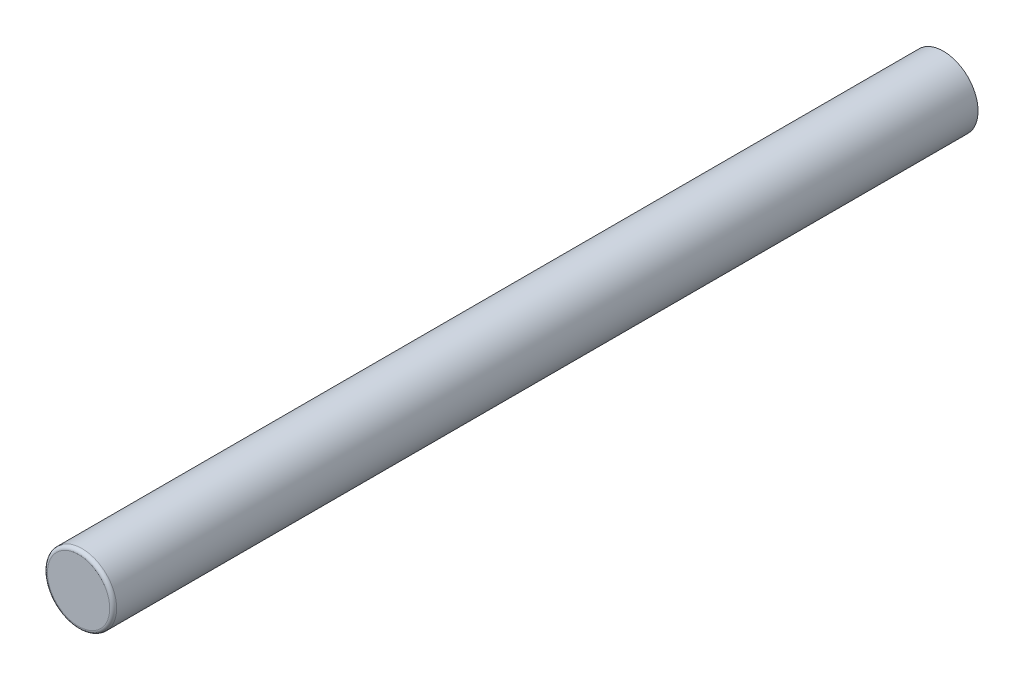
ISO-10303-21;
HEADER;
FILE_DESCRIPTION(('STEP AP214'),'2;1');
FILE_NAME('part.step','',(''),(''),'','','');
FILE_SCHEMA(('AUTOMOTIVE_DESIGN { 1 0 10303 214 1 1 1 1 }'));
ENDSEC;
DATA;
#1=APPLICATION_CONTEXT('core data for automotive mechanical design processes');
#2=APPLICATION_PROTOCOL_DEFINITION('international standard','automotive_design',2000,#1);
#3=PRODUCT_CONTEXT('',#1,'mechanical');
#4=PRODUCT('Part','Part','',(#3));
#5=PRODUCT_RELATED_PRODUCT_CATEGORY('part','',(#4));
#6=PRODUCT_DEFINITION_FORMATION('','',#4);
#7=PRODUCT_DEFINITION_CONTEXT('part definition',#1,'design');
#8=PRODUCT_DEFINITION('design','',#6,#7);
#9=PRODUCT_DEFINITION_SHAPE('','',#8);
#10=(LENGTH_UNIT() NAMED_UNIT(*) SI_UNIT(.MILLI.,.METRE.));
#11=(NAMED_UNIT(*) PLANE_ANGLE_UNIT() SI_UNIT($,.RADIAN.));
#12=(NAMED_UNIT(*) SI_UNIT($,.STERADIAN.) SOLID_ANGLE_UNIT());
#13=UNCERTAINTY_MEASURE_WITH_UNIT(LENGTH_MEASURE(1.E-05),#10,'distance_accuracy_value','');
#14=(GEOMETRIC_REPRESENTATION_CONTEXT(3) GLOBAL_UNCERTAINTY_ASSIGNED_CONTEXT((#13)) GLOBAL_UNIT_ASSIGNED_CONTEXT((#10,
#11,#12)) REPRESENTATION_CONTEXT('',''));
#15=CARTESIAN_POINT('',(0.,0.,0.));
#16=DIRECTION('',(0.,0.,1.));
#17=DIRECTION('',(1.,0.,0.));
#18=AXIS2_PLACEMENT_3D('',#15,#16,#17);
#19=CARTESIAN_POINT('',(0.,0.,12.5));
#20=DIRECTION('',(0.,0.,-1.));
#21=DIRECTION('',(-1.,0.,0.));
#22=AXIS2_PLACEMENT_3D('',#19,#20,#21);
#23=CYLINDRICAL_SURFACE('',#22,0.999999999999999);
#24=CARTESIAN_POINT('',(0.,0.,12.4));
#25=DIRECTION('',(0.,0.,1.));
#26=DIRECTION('',(1.,0.,0.));
#27=AXIS2_PLACEMENT_3D('',#24,#25,#26);
#28=CIRCLE('',#27,0.999999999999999);
#29=CARTESIAN_POINT('',(-0.999999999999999,0.,12.4));
#30=VERTEX_POINT('',#29);
#31=EDGE_CURVE('E10',#30,#30,#28,.F.);
#32=CARTESIAN_POINT('',(0.,0.,-12.5));
#33=DIRECTION('',(0.,0.,1.));
#34=DIRECTION('',(1.,0.,0.));
#35=AXIS2_PLACEMENT_3D('',#32,#33,#34);
#36=CIRCLE('',#35,0.999999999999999);
#37=CARTESIAN_POINT('',(-0.999999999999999,0.,-12.5));
#38=VERTEX_POINT('',#37);
#39=EDGE_CURVE('E38',#38,#38,#36,.T.);
#40=CARTESIAN_POINT('',(-0.999999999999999,0.,12.4));
#41=CARTESIAN_POINT('',(-0.999999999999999,0.,12.140625));
#42=CARTESIAN_POINT('',(-0.999999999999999,0.,11.88125));
#43=CARTESIAN_POINT('',(-0.999999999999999,0.,11.3625));
#44=CARTESIAN_POINT('',(-0.999999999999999,0.,11.103125));
#45=CARTESIAN_POINT('',(-0.999999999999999,0.,10.584375));
#46=CARTESIAN_POINT('',(-0.999999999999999,0.,10.325));
#47=CARTESIAN_POINT('',(-0.999999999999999,0.,9.80624999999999));
#48=CARTESIAN_POINT('',(-0.999999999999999,0.,9.54687499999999));
#49=CARTESIAN_POINT('',(-0.999999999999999,0.,9.02812499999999));
#50=CARTESIAN_POINT('',(-0.999999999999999,0.,8.76874999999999));
#51=CARTESIAN_POINT('',(-0.999999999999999,0.,8.24999999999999));
#52=CARTESIAN_POINT('',(-0.999999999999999,0.,7.99062499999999));
#53=CARTESIAN_POINT('',(-0.999999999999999,0.,7.471875));
#54=CARTESIAN_POINT('',(-0.999999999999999,0.,7.2125));
#55=CARTESIAN_POINT('',(-0.999999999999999,0.,6.69375));
#56=CARTESIAN_POINT('',(-0.999999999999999,0.,6.434375));
#57=CARTESIAN_POINT('',(-0.999999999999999,0.,5.915625));
#58=CARTESIAN_POINT('',(-0.999999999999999,0.,5.65625));
#59=CARTESIAN_POINT('',(-0.999999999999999,0.,5.1375));
#60=CARTESIAN_POINT('',(-0.999999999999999,0.,4.878125));
#61=CARTESIAN_POINT('',(-0.999999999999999,0.,4.359375));
#62=CARTESIAN_POINT('',(-0.999999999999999,0.,4.1));
#63=CARTESIAN_POINT('',(-0.999999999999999,0.,3.58125));
#64=CARTESIAN_POINT('',(-0.999999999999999,0.,3.321875));
#65=CARTESIAN_POINT('',(-0.999999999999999,0.,2.803125));
#66=CARTESIAN_POINT('',(-0.999999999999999,0.,2.54375));
#67=CARTESIAN_POINT('',(-0.999999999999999,0.,2.025));
#68=CARTESIAN_POINT('',(-0.999999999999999,0.,1.765625));
#69=CARTESIAN_POINT('',(-0.999999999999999,0.,1.246875));
#70=CARTESIAN_POINT('',(-0.999999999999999,0.,0.987499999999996));
#71=CARTESIAN_POINT('',(-0.999999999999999,0.,0.468749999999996));
#72=CARTESIAN_POINT('',(-0.999999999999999,0.,0.209374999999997));
#73=CARTESIAN_POINT('',(-0.999999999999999,0.,-0.309375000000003));
#74=CARTESIAN_POINT('',(-0.999999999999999,0.,-0.568750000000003));
#75=CARTESIAN_POINT('',(-0.999999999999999,0.,-1.0875));
#76=CARTESIAN_POINT('',(-0.999999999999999,0.,-1.346875));
#77=CARTESIAN_POINT('',(-0.999999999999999,0.,-1.865625));
#78=CARTESIAN_POINT('',(-0.999999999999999,0.,-2.125));
#79=CARTESIAN_POINT('',(-0.999999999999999,0.,-2.64375));
#80=CARTESIAN_POINT('',(-0.999999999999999,0.,-2.903125));
#81=CARTESIAN_POINT('',(-0.999999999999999,0.,-3.421875));
#82=CARTESIAN_POINT('',(-0.999999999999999,0.,-3.68125));
#83=CARTESIAN_POINT('',(-0.999999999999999,0.,-4.2));
#84=CARTESIAN_POINT('',(-0.999999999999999,0.,-4.459375));
#85=CARTESIAN_POINT('',(-0.999999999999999,0.,-4.978125));
#86=CARTESIAN_POINT('',(-0.999999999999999,0.,-5.2375));
#87=CARTESIAN_POINT('',(-0.999999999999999,0.,-5.75625));
#88=CARTESIAN_POINT('',(-0.999999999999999,0.,-6.015625));
#89=CARTESIAN_POINT('',(-0.999999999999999,0.,-6.534375));
#90=CARTESIAN_POINT('',(-0.999999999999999,0.,-6.79375));
#91=CARTESIAN_POINT('',(-0.999999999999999,0.,-7.3125));
#92=CARTESIAN_POINT('',(-0.999999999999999,0.,-7.571875));
#93=CARTESIAN_POINT('',(-0.999999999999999,0.,-8.090625));
#94=CARTESIAN_POINT('',(-0.999999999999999,0.,-8.35));
#95=CARTESIAN_POINT('',(-0.999999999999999,0.,-8.86875));
#96=CARTESIAN_POINT('',(-0.999999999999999,0.,-9.128125));
#97=CARTESIAN_POINT('',(-0.999999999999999,0.,-9.646875));
#98=CARTESIAN_POINT('',(-0.999999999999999,0.,-9.90625));
#99=CARTESIAN_POINT('',(-0.999999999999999,0.,-10.425));
#100=CARTESIAN_POINT('',(-0.999999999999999,0.,-10.684375));
#101=CARTESIAN_POINT('',(-0.999999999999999,0.,-11.203125));
#102=CARTESIAN_POINT('',(-0.999999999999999,0.,-11.4625));
#103=CARTESIAN_POINT('',(-0.999999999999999,0.,-11.98125));
#104=CARTESIAN_POINT('',(-0.999999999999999,0.,-12.240625));
#105=CARTESIAN_POINT('',(-0.999999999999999,0.,-12.5));
#106=B_SPLINE_CURVE_WITH_KNOTS('',3,(#40,#41,#42,#43,#44,#45,#46,#47,#48,#49,#50,#51,#52,#53,
#54,#55,#56,#57,#58,#59,#60,#61,#62,#63,#64,#65,#66,#67,#68,#69,#70,#71,#72,#73,#74,#75,#76,#77,
#78,#79,#80,#81,#82,#83,#84,#85,#86,#87,#88,#89,#90,#91,#92,#93,#94,#95,#96,#97,#98,#99,#100,
#101,#102,#103,#104,#105),.UNSPECIFIED.,.F.,.F.,(4,2,2,2,2,2,2,2,2,2,2,2,2,2,2,2,2,2,2,2,2,2,2,
2,2,2,2,2,2,2,2,2,4),(0.,0.778124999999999,1.55625,2.334375,3.1125,3.890625,4.66875,5.446875,
6.225,7.003125,7.78125,8.559375,9.3375,10.115625,10.89375,11.671875,12.45,13.228125,14.00625,
14.784375,15.5625,16.340625,17.11875,17.896875,18.675,19.453125,20.23125,21.009375,21.7875,
22.565625,23.34375,24.121875,24.9),.UNSPECIFIED.);
#107=EDGE_CURVE('BSEAM28',#30,#38,#106,.T.);
#108=ORIENTED_EDGE('',*,*,#31,.T.);
#109=ORIENTED_EDGE('',*,*,#39,.T.);
#110=ORIENTED_EDGE('',*,*,#107,.T.);
#111=ORIENTED_EDGE('',*,*,#107,.F.);
#112=EDGE_LOOP('',(#108,#110,#109,#111));
#113=FACE_BOUND('',#112,.T.);
#114=ADVANCED_FACE('F28',(#113),#23,.T.);
#115=CARTESIAN_POINT('',(0.,0.,12.5));
#116=DIRECTION('',(0.,0.,1.));
#117=DIRECTION('',(1.,0.,0.));
#118=AXIS2_PLACEMENT_3D('',#115,#116,#117);
#119=PLANE('',#118);
#120=CARTESIAN_POINT('',(0.,0.,12.5));
#121=DIRECTION('',(0.,0.,1.));
#122=DIRECTION('',(1.,0.,0.));
#123=AXIS2_PLACEMENT_3D('',#120,#121,#122);
#124=CIRCLE('',#123,0.899999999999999);
#125=CARTESIAN_POINT('',(0.899999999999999,0.,12.5));
#126=VERTEX_POINT('',#125);
#127=EDGE_CURVE('E34',#126,#126,#124,.T.);
#128=ORIENTED_EDGE('',*,*,#127,.T.);
#129=EDGE_LOOP('',(#128));
#130=FACE_BOUND('',#129,.T.);
#131=ADVANCED_FACE('F49',(#130),#119,.T.);
#132=CARTESIAN_POINT('',(0.,0.,-12.5));
#133=DIRECTION('',(0.,0.,1.));
#134=DIRECTION('',(1.,0.,0.));
#135=AXIS2_PLACEMENT_3D('',#132,#133,#134);
#136=PLANE('',#135);
#137=ORIENTED_EDGE('',*,*,#39,.F.);
#138=EDGE_LOOP('',(#137));
#139=FACE_BOUND('',#138,.T.);
#140=ADVANCED_FACE('F46',(#139),#136,.F.);
#141=CARTESIAN_POINT('',(0.,0.,12.4));
#142=DIRECTION('',(0.,0.,1.));
#143=DIRECTION('',(1.,0.,0.));
#144=AXIS2_PLACEMENT_3D('',#141,#142,#143);
#145=TOROIDAL_SURFACE('',#144,0.899999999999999,0.1);
#146=ORIENTED_EDGE('',*,*,#31,.F.);
#147=EDGE_LOOP('',(#146));
#148=FACE_BOUND('',#147,.T.);
#149=ORIENTED_EDGE('',*,*,#127,.F.);
#150=EDGE_LOOP('',(#149));
#151=FACE_BOUND('',#150,.T.);
#152=ADVANCED_FACE('F48',(#148,#151),#145,.T.);
#153=CLOSED_SHELL('',(#114,#131,#140,#152));
#154=MANIFOLD_SOLID_BREP('B2',#153);
#155=ADVANCED_BREP_SHAPE_REPRESENTATION('',(#18,#154),#14);
#156=SHAPE_DEFINITION_REPRESENTATION(#9,#155);
ENDSEC;
END-ISO-10303-21;
